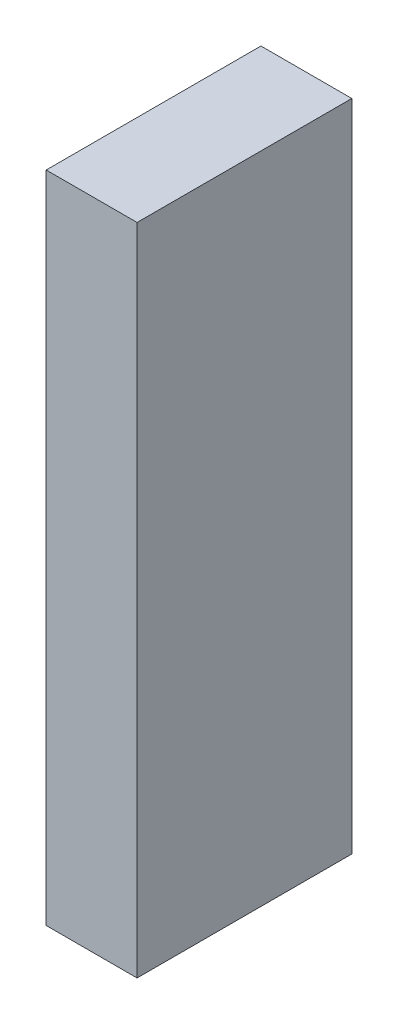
from build123d import *

# Parameters (mm, degrees)
SKETCH1_W           = 254
SKETCH1_H           = 600.2
BOSS_EXTRUDE1_DEPTH = 1828.8


with BuildPart() as part:
    # Sketch1 → Boss-Extrude1 (new body)
    with BuildSketch(Plane(origin=(0, 0, 0), x_dir=(1, 0, 0), z_dir=(0, 1, 0))):
        Rectangle(SKETCH1_W, SKETCH1_H)
    extrude(amount=BOSS_EXTRUDE1_DEPTH)


solid = part.part
